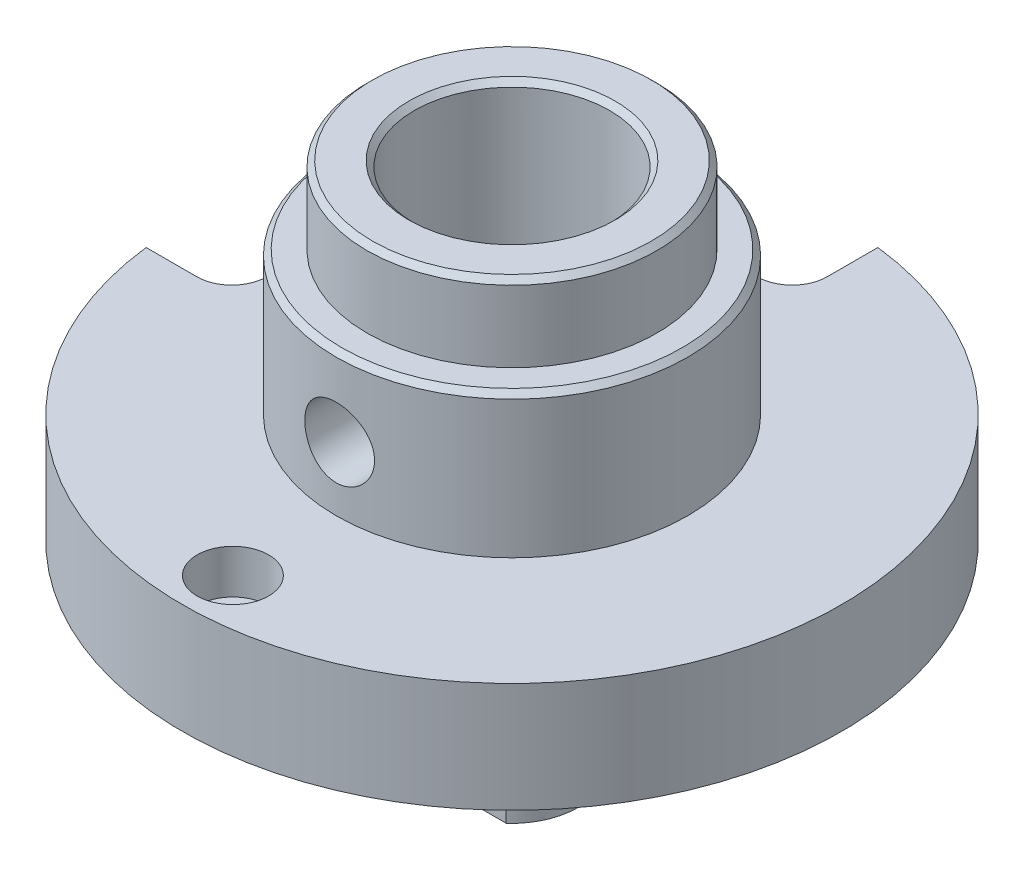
ISO-10303-21;
HEADER;
FILE_DESCRIPTION(('STEP AP214'),'2;1');
FILE_NAME('part.step','',(''),(''),'','','');
FILE_SCHEMA(('AUTOMOTIVE_DESIGN { 1 0 10303 214 1 1 1 1 }'));
ENDSEC;
DATA;
#1=APPLICATION_CONTEXT('core data for automotive mechanical design processes');
#2=APPLICATION_PROTOCOL_DEFINITION('international standard','automotive_design',2000,#1);
#3=PRODUCT_CONTEXT('',#1,'mechanical');
#4=PRODUCT('Part','Part','',(#3));
#5=PRODUCT_RELATED_PRODUCT_CATEGORY('part','',(#4));
#6=PRODUCT_DEFINITION_FORMATION('','',#4);
#7=PRODUCT_DEFINITION_CONTEXT('part definition',#1,'design');
#8=PRODUCT_DEFINITION('design','',#6,#7);
#9=PRODUCT_DEFINITION_SHAPE('','',#8);
#10=(LENGTH_UNIT() NAMED_UNIT(*) SI_UNIT(.MILLI.,.METRE.));
#11=(NAMED_UNIT(*) PLANE_ANGLE_UNIT() SI_UNIT($,.RADIAN.));
#12=(NAMED_UNIT(*) SI_UNIT($,.STERADIAN.) SOLID_ANGLE_UNIT());
#13=UNCERTAINTY_MEASURE_WITH_UNIT(LENGTH_MEASURE(1.E-05),#10,'distance_accuracy_value','');
#14=(GEOMETRIC_REPRESENTATION_CONTEXT(3) GLOBAL_UNCERTAINTY_ASSIGNED_CONTEXT((#13)) GLOBAL_UNIT_ASSIGNED_CONTEXT((#10,
#11,#12)) REPRESENTATION_CONTEXT('',''));
#15=CARTESIAN_POINT('',(0.,0.,0.));
#16=DIRECTION('',(0.,0.,1.));
#17=DIRECTION('',(1.,0.,0.));
#18=AXIS2_PLACEMENT_3D('',#15,#16,#17);
#19=CARTESIAN_POINT('',(0.,-70.5,0.));
#20=DIRECTION('',(0.,-1.,0.));
#21=DIRECTION('',(0.,0.,-1.));
#22=AXIS2_PLACEMENT_3D('',#19,#20,#21);
#23=CYLINDRICAL_SURFACE('',#22,8.);
#24=CARTESIAN_POINT('',(0.,11.25,0.));
#25=DIRECTION('',(0.,1.,0.));
#26=DIRECTION('',(0.,0.,1.));
#27=AXIS2_PLACEMENT_3D('',#24,#25,#26);
#28=CIRCLE('',#27,8.);
#29=CARTESIAN_POINT('',(0.,11.25,8.));
#30=VERTEX_POINT('',#29);
#31=EDGE_CURVE('E318',#30,#30,#28,.F.);
#32=ORIENTED_EDGE('',*,*,#31,.T.);
#33=EDGE_LOOP('',(#32));
#34=FACE_BOUND('',#33,.T.);
#35=CARTESIAN_POINT('',(0.,5.,0.));
#36=DIRECTION('',(0.,-1.,0.));
#37=DIRECTION('',(0.,0.,-1.));
#38=AXIS2_PLACEMENT_3D('',#35,#36,#37);
#39=CIRCLE('',#38,8.);
#40=CARTESIAN_POINT('',(0.,5.,-8.));
#41=VERTEX_POINT('',#40);
#42=EDGE_CURVE('E168',#41,#41,#39,.T.);
#43=ORIENTED_EDGE('',*,*,#42,.F.);
#44=EDGE_LOOP('',(#43));
#45=FACE_BOUND('',#44,.T.);
#46=CARTESIAN_POINT('',(0.,9.47750000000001,-8.));
#47=CARTESIAN_POINT('',(0.0882427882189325,9.47749673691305,-7.99999837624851));
#48=CARTESIAN_POINT('',(0.176526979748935,9.47011754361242,-7.99852498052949));
#49=CARTESIAN_POINT('',(0.350600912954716,9.44081861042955,-7.99278941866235));
#50=CARTESIAN_POINT('',(0.436388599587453,9.41888722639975,-7.98852501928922));
#51=CARTESIAN_POINT('',(0.602927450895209,9.36118729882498,-7.97768374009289));
#52=CARTESIAN_POINT('',(0.683683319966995,9.32543191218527,-7.97110905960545));
#53=CARTESIAN_POINT('',(0.838044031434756,9.24113781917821,-7.9563623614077));
#54=CARTESIAN_POINT('',(0.911649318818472,9.19259990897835,-7.94819044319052));
#55=CARTESIAN_POINT('',(1.05060737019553,9.08343189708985,-7.93102709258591));
#56=CARTESIAN_POINT('',(1.1158509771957,9.02266419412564,-7.92202703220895));
#57=CARTESIAN_POINT('',(1.23528857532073,8.89105739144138,-7.90428469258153));
#58=CARTESIAN_POINT('',(1.28948171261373,8.82021751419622,-7.89554243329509));
#59=CARTESIAN_POINT('',(1.38574328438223,8.66969383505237,-7.87922132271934));
#60=CARTESIAN_POINT('',(1.42769894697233,8.58993660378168,-7.87165357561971));
#61=CARTESIAN_POINT('',(1.49757221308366,8.42432983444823,-7.85866074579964));
#62=CARTESIAN_POINT('',(1.52549118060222,8.33848088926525,-7.85323545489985));
#63=CARTESIAN_POINT('',(1.56614469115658,8.16430122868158,-7.84522904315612));
#64=CARTESIAN_POINT('',(1.57907060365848,8.07601685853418,-7.84261210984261));
#65=CARTESIAN_POINT('',(1.58996544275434,7.89849673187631,-7.84041089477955));
#66=CARTESIAN_POINT('',(1.58793587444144,7.80926107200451,-7.84082630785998));
#67=CARTESIAN_POINT('',(1.56913214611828,7.63376978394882,-7.84461030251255));
#68=CARTESIAN_POINT('',(1.55257713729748,7.54748958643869,-7.84793498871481));
#69=CARTESIAN_POINT('',(1.50553828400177,7.37895603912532,-7.85709382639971));
#70=CARTESIAN_POINT('',(1.47505378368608,7.29670287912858,-7.86292809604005));
#71=CARTESIAN_POINT('',(1.40081138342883,7.13792546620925,-7.87649373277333));
#72=CARTESIAN_POINT('',(1.35696641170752,7.06144302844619,-7.88423747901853));
#73=CARTESIAN_POINT('',(1.25730912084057,6.9168387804,-7.90074156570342));
#74=CARTESIAN_POINT('',(1.20149544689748,6.84871791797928,-7.90950202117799));
#75=CARTESIAN_POINT('',(1.07831068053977,6.72150575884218,-7.9272427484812));
#76=CARTESIAN_POINT('',(1.01075249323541,6.66259564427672,-7.93622416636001));
#77=CARTESIAN_POINT('',(0.866618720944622,6.55691566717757,-7.95325277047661));
#78=CARTESIAN_POINT('',(0.790043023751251,6.51014595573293,-7.96129994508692));
#79=CARTESIAN_POINT('',(0.629848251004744,6.4300417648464,-7.97557267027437));
#80=CARTESIAN_POINT('',(0.546218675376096,6.39672775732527,-7.98179544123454));
#81=CARTESIAN_POINT('',(0.374398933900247,6.34467252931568,-7.99169707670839));
#82=CARTESIAN_POINT('',(0.286209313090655,6.32592957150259,-7.9953762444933));
#83=CARTESIAN_POINT('',(0.109330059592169,6.30380444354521,-7.99973396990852));
#84=CARTESIAN_POINT('',(0.0206726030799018,6.30017428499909,-8.00046096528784));
#85=CARTESIAN_POINT('',(-0.155982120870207,6.30771027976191,-7.9989668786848));
#86=CARTESIAN_POINT('',(-0.243979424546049,6.31887561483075,-7.99674595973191));
#87=CARTESIAN_POINT('',(-0.416017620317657,6.35547960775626,-7.98963588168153));
#88=CARTESIAN_POINT('',(-0.500086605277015,6.38079124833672,-7.98477047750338));
#89=CARTESIAN_POINT('',(-0.662787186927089,6.44483072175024,-7.97291496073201));
#90=CARTESIAN_POINT('',(-0.741418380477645,6.48355954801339,-7.96592469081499));
#91=CARTESIAN_POINT('',(-0.892058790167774,6.5738720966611,-7.95047418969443));
#92=CARTESIAN_POINT('',(-0.9639765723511,6.62560540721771,-7.94199722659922));
#93=CARTESIAN_POINT('',(-1.09819915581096,6.74025783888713,-7.92455347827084));
#94=CARTESIAN_POINT('',(-1.16050294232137,6.80317813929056,-7.91558664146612));
#95=CARTESIAN_POINT('',(-1.27468416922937,6.93954661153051,-7.89801082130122));
#96=CARTESIAN_POINT('',(-1.32639149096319,7.01313833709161,-7.88940920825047));
#97=CARTESIAN_POINT('',(-1.41671133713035,7.1681084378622,-7.87369286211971));
#98=CARTESIAN_POINT('',(-1.45532438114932,7.24948650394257,-7.86657807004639));
#99=CARTESIAN_POINT('',(-1.51812618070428,7.41731226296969,-7.8547002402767));
#100=CARTESIAN_POINT('',(-1.54238909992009,7.50373130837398,-7.84992513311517));
#101=CARTESIAN_POINT('',(-1.57602735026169,7.67952432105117,-7.84324149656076));
#102=CARTESIAN_POINT('',(-1.58540458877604,7.7688979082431,-7.84133259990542));
#103=CARTESIAN_POINT('',(-1.58893556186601,7.94635551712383,-7.8406176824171));
#104=CARTESIAN_POINT('',(-1.58335805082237,8.03443408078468,-7.84175688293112));
#105=CARTESIAN_POINT('',(-1.55773038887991,8.20837086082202,-7.84688752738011));
#106=CARTESIAN_POINT('',(-1.53768035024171,8.29422909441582,-7.85087894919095));
#107=CARTESIAN_POINT('',(-1.48379584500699,8.46112040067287,-7.86123999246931));
#108=CARTESIAN_POINT('',(-1.4499938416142,8.54216432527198,-7.86760401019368));
#109=CARTESIAN_POINT('',(-1.36959557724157,8.69747279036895,-7.88199647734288));
#110=CARTESIAN_POINT('',(-1.32299826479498,8.77173677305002,-7.89002506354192));
#111=CARTESIAN_POINT('',(-1.21741207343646,8.91271654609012,-7.9070099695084));
#112=CARTESIAN_POINT('',(-1.15822891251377,8.97928525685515,-7.91597956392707));
#113=CARTESIAN_POINT('',(-1.02955264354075,9.10163561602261,-7.93374005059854));
#114=CARTESIAN_POINT('',(-0.960057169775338,9.1574147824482,-7.94253090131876));
#115=CARTESIAN_POINT('',(-0.811871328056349,9.25714310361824,-7.95904983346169));
#116=CARTESIAN_POINT('',(-0.733093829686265,9.30096483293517,-7.96676606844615));
#117=CARTESIAN_POINT('',(-0.569162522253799,9.37467903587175,-7.98014988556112));
#118=CARTESIAN_POINT('',(-0.484014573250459,9.40458413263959,-7.9858193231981));
#119=CARTESIAN_POINT('',(-0.332223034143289,9.44378837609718,-7.99336234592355));
#120=CARTESIAN_POINT('',(-0.266446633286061,9.45640781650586,-7.99583696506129));
#121=CARTESIAN_POINT('',(-0.133788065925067,9.47326473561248,-7.99915638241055));
#122=CARTESIAN_POINT('',(-0.0669059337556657,9.47750247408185,-8.00000123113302));
#123=CARTESIAN_POINT('',(0.,9.47750000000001,-8.));
#124=B_SPLINE_CURVE_WITH_KNOTS('',3,(#46,#47,#48,#49,#50,#51,#52,#53,#54,#55,#56,#57,#58,#59,
#60,#61,#62,#63,#64,#65,#66,#67,#68,#69,#70,#71,#72,#73,#74,#75,#76,#77,#78,#79,#80,#81,#82,#83,
#84,#85,#86,#87,#88,#89,#90,#91,#92,#93,#94,#95,#96,#97,#98,#99,#100,#101,#102,#103,#104,#105,
#106,#107,#108,#109,#110,#111,#112,#113,#114,#115,#116,#117,#118,#119,#120,#121,#122,#123),
.UNSPECIFIED.,.T.,.F.,(4,2,2,2,2,2,2,2,2,2,2,2,2,2,2,2,2,2,2,2,2,2,2,2,2,2,2,2,2,2,2,2,2,2,2,2,
2,2,4),(0.,0.264483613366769,0.529179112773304,0.7936233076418,1.05805103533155,
1.32563942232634,1.59324847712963,1.86325089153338,2.13322706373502,2.39971799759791,
2.66618211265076,2.92869379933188,3.19121784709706,3.4554907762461,3.71979363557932,
3.98877505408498,4.25775981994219,4.52715229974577,4.79651265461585,5.06143517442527,
5.32634304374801,5.58890970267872,5.85149580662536,6.11725290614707,6.38303803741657,
6.65280357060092,6.92255839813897,7.19090662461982,7.45922046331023,7.7227448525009,
7.98626719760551,8.24917104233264,8.51209649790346,8.77942102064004,9.04680696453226,
9.3169399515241,9.58682743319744,9.78736587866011,9.98789810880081),.UNSPECIFIED.);
#125=CARTESIAN_POINT('',(0.,9.47750000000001,-8.));
#126=VERTEX_POINT('',#125);
#127=EDGE_CURVE('E193',#126,#126,#124,.T.);
#128=ORIENTED_EDGE('',*,*,#127,.F.);
#129=EDGE_LOOP('',(#128));
#130=FACE_BOUND('',#129,.T.);
#131=CARTESIAN_POINT('',(-1.5875,7.89,7.84090834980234));
#132=CARTESIAN_POINT('',(-1.58749672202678,7.9782235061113,7.84091009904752));
#133=CARTESIAN_POINT('',(-1.58012064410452,8.06648845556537,7.84241353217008));
#134=CARTESIAN_POINT('',(-1.55083520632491,8.24052243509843,7.84825616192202));
#135=CARTESIAN_POINT('',(-1.52891412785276,8.32628939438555,7.85259764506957));
#136=CARTESIAN_POINT('',(-1.47124432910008,8.4927843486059,7.86360575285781));
#137=CARTESIAN_POINT('',(-1.43550924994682,8.57351722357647,7.87027008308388));
#138=CARTESIAN_POINT('',(-1.3512630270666,8.72783916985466,7.8851702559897));
#139=CARTESIAN_POINT('',(-1.30275263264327,8.80142865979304,7.89340600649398));
#140=CARTESIAN_POINT('',(-1.19361283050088,8.94040356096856,7.91064916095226));
#141=CARTESIAN_POINT('',(-1.13283964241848,9.00567504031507,7.91966491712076));
#142=CARTESIAN_POINT('',(-1.00121003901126,9.12516671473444,7.93737869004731));
#143=CARTESIAN_POINT('',(-0.9303529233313,9.17938614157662,7.94607668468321));
#144=CARTESIAN_POINT('',(-0.779813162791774,9.27567600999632,7.96226490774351));
#145=CARTESIAN_POINT('',(-0.700060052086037,9.31763829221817,7.96974414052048));
#146=CARTESIAN_POINT('',(-0.534462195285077,9.38752492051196,7.98255835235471));
#147=CARTESIAN_POINT('',(-0.44861801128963,9.41545056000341,7.98789352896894));
#148=CARTESIAN_POINT('',(-0.274456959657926,9.45611683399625,7.99575949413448));
#149=CARTESIAN_POINT('',(-0.186186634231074,9.46904981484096,7.9983257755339));
#150=CARTESIAN_POINT('',(-0.00869430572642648,9.47996366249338,8.00048734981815));
#151=CARTESIAN_POINT('',(0.0805276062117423,9.47794594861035,8.0000829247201));
#152=CARTESIAN_POINT('',(0.256069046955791,9.45916177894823,7.99637618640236));
#153=CARTESIAN_POINT('',(0.342411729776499,9.44260250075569,7.99311458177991));
#154=CARTESIAN_POINT('',(0.51106800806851,9.39553375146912,7.98410583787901));
#155=CARTESIAN_POINT('',(0.593381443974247,9.36502372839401,7.97835860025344));
#156=CARTESIAN_POINT('',(0.752234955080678,9.29072692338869,7.96495714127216));
#157=CARTESIAN_POINT('',(0.828735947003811,9.24685876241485,7.95729128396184));
#158=CARTESIAN_POINT('',(0.973367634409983,9.14715112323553,7.94089800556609));
#159=CARTESIAN_POINT('',(1.04149737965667,9.09131028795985,7.93217046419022));
#160=CARTESIAN_POINT('',(1.16868185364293,8.96810520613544,7.91444145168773));
#161=CARTESIAN_POINT('',(1.22756078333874,8.9005596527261,7.9054378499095));
#162=CARTESIAN_POINT('',(1.33318371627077,8.75646261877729,7.88831368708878));
#163=CARTESIAN_POINT('',(1.37992749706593,8.67991097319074,7.88019314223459));
#164=CARTESIAN_POINT('',(1.46001252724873,8.51972478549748,7.86575048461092));
#165=CARTESIAN_POINT('',(1.49332569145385,8.43607583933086,7.85943214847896));
#166=CARTESIAN_POINT('',(1.54537339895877,8.26421370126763,7.84936500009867));
#167=CARTESIAN_POINT('',(1.56410981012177,8.17600109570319,7.84561585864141));
#168=CARTESIAN_POINT('',(1.586210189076,7.99910797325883,7.84117743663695));
#169=CARTESIAN_POINT('',(1.58982785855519,7.91046038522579,7.84043766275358));
#170=CARTESIAN_POINT('',(1.58227041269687,7.73382831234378,7.84196625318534));
#171=CARTESIAN_POINT('',(1.57109612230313,7.64584379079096,7.84423444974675));
#172=CARTESIAN_POINT('',(1.53449055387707,7.47388576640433,7.85147615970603));
#173=CARTESIAN_POINT('',(1.50919450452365,7.38988229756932,7.85642399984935));
#174=CARTESIAN_POINT('',(1.44520793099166,7.22730591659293,7.86844503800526));
#175=CARTESIAN_POINT('',(1.40651631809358,7.14873344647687,7.87551840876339));
#176=CARTESIAN_POINT('',(1.31626140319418,6.99813834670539,7.89110715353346));
#177=CARTESIAN_POINT('',(1.26453915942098,6.92621280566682,7.89963988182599));
#178=CARTESIAN_POINT('',(1.1499033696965,6.79196948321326,7.91713814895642));
#179=CARTESIAN_POINT('',(1.08698869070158,6.72965267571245,7.92610373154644));
#180=CARTESIAN_POINT('',(0.950615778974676,6.61543567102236,7.94362118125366));
#181=CARTESIAN_POINT('',(0.877012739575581,6.5637068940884,7.95216476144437));
#182=CARTESIAN_POINT('',(0.722013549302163,6.47334944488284,7.96773206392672));
#183=CARTESIAN_POINT('',(0.6406177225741,6.4347202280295,7.97475584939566));
#184=CARTESIAN_POINT('',(0.472797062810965,6.37190916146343,7.98645675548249));
#185=CARTESIAN_POINT('',(0.386403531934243,6.34764623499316,7.99114702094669));
#186=CARTESIAN_POINT('',(0.210664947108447,6.31399935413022,7.99770876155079));
#187=CARTESIAN_POINT('',(0.121320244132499,6.30461363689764,7.99958057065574));
#188=CARTESIAN_POINT('',(-0.0561463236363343,6.30105498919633,8.00028676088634));
#189=CARTESIAN_POINT('',(-0.144262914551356,6.30662418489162,7.99917263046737));
#190=CARTESIAN_POINT('',(-0.318277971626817,6.33224848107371,7.99414021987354));
#191=CARTESIAN_POINT('',(-0.404176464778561,6.35230340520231,7.99022197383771));
#192=CARTESIAN_POINT('',(-0.571159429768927,6.40621600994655,7.98002285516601));
#193=CARTESIAN_POINT('',(-0.652254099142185,6.44004315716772,7.97374721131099));
#194=CARTESIAN_POINT('',(-0.807653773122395,6.52050760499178,7.95950948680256));
#195=CARTESIAN_POINT('',(-0.881958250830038,6.56714589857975,7.95154727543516));
#196=CARTESIAN_POINT('',(-1.02294464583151,6.67278089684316,7.93465259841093));
#197=CARTESIAN_POINT('',(-1.08948656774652,6.73196232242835,7.92570671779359));
#198=CARTESIAN_POINT('',(-1.21178368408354,6.86062362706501,7.90793326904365));
#199=CARTESIAN_POINT('',(-1.26753632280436,6.93010593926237,7.89910572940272));
#200=CARTESIAN_POINT('',(-1.36723145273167,7.07827765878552,7.88246577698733));
#201=CARTESIAN_POINT('',(-1.41104284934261,7.15705664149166,7.87466508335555));
#202=CARTESIAN_POINT('',(-1.48473734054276,7.32099016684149,7.86110490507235));
#203=CARTESIAN_POINT('',(-1.51463313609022,7.40613881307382,7.85534356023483));
#204=CARTESIAN_POINT('',(-1.55381483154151,7.55790648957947,7.84767103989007));
#205=CARTESIAN_POINT('',(-1.56642429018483,7.62365687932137,7.84515066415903));
#206=CARTESIAN_POINT('',(-1.58326797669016,7.75626359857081,7.84176868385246));
#207=CARTESIAN_POINT('',(-1.58750248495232,7.82311989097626,7.84090702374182));
#208=CARTESIAN_POINT('',(-1.5875,7.89,7.84090834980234));
#209=B_SPLINE_CURVE_WITH_KNOTS('',3,(#131,#132,#133,#134,#135,#136,#137,#138,#139,#140,#141,
#142,#143,#144,#145,#146,#147,#148,#149,#150,#151,#152,#153,#154,#155,#156,#157,#158,#159,#160,
#161,#162,#163,#164,#165,#166,#167,#168,#169,#170,#171,#172,#173,#174,#175,#176,#177,#178,#179,
#180,#181,#182,#183,#184,#185,#186,#187,#188,#189,#190,#191,#192,#193,#194,#195,#196,#197,#198,
#199,#200,#201,#202,#203,#204,#205,#206,#207,#208),.UNSPECIFIED.,.T.,.F.,(4,2,2,2,2,2,2,2,2,2,2,
2,2,2,2,2,2,2,2,2,2,2,2,2,2,2,2,2,2,2,2,2,2,2,2,2,2,2,4),(0.,0.264425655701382,
0.529064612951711,0.793442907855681,1.05780569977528,1.32546993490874,1.59315276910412,
1.86313088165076,2.13308411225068,2.39953428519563,2.66595916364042,2.9286487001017,
3.19134863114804,3.45568210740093,3.72004556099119,3.98894572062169,4.25785080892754,
4.52731533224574,4.79674532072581,5.06163549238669,5.32651089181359,5.58889233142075,
5.85129510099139,6.11706818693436,6.38286819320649,6.65268006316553,6.92248071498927,
7.19074385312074,7.45897520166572,7.72261115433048,7.98624389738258,8.24929531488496,
8.51236712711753,8.77962209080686,9.04694028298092,9.31708469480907,9.58698205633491,
9.78744347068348,9.98789817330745),.UNSPECIFIED.);
#210=CARTESIAN_POINT('',(-1.5875,7.89,7.84090834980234));
#211=VERTEX_POINT('',#210);
#212=EDGE_CURVE('E194',#211,#211,#209,.T.);
#213=ORIENTED_EDGE('',*,*,#212,.T.);
#214=EDGE_LOOP('',(#213));
#215=FACE_BOUND('',#214,.T.);
#216=ADVANCED_FACE('F40',(#34,#45,#130,#215),#23,.T.);
#217=CARTESIAN_POINT('',(0.,-70.5,0.));
#218=DIRECTION('',(0.,-1.,0.));
#219=DIRECTION('',(0.,0.,-1.));
#220=AXIS2_PLACEMENT_3D('',#217,#218,#219);
#221=CYLINDRICAL_SURFACE('',#220,4.445);
#222=CARTESIAN_POINT('',(0.,14.75,0.));
#223=DIRECTION('',(0.,1.,0.));
#224=DIRECTION('',(0.,0.,1.));
#225=AXIS2_PLACEMENT_3D('',#222,#223,#224);
#226=CIRCLE('',#225,4.445);
#227=CARTESIAN_POINT('',(0.,14.75,4.445));
#228=VERTEX_POINT('',#227);
#229=EDGE_CURVE('E322',#228,#228,#226,.T.);
#230=ORIENTED_EDGE('',*,*,#229,.T.);
#231=EDGE_LOOP('',(#230));
#232=FACE_BOUND('',#231,.T.);
#233=CARTESIAN_POINT('',(0.,3.,0.));
#234=DIRECTION('',(0.,-1.,0.));
#235=DIRECTION('',(0.,0.,-1.));
#236=AXIS2_PLACEMENT_3D('',#233,#234,#235);
#237=CIRCLE('',#236,4.445);
#238=CARTESIAN_POINT('',(0.,3.,-4.445));
#239=VERTEX_POINT('',#238);
#240=EDGE_CURVE('E222',#239,#239,#237,.T.);
#241=ORIENTED_EDGE('',*,*,#240,.T.);
#242=EDGE_LOOP('',(#241));
#243=FACE_BOUND('',#242,.T.);
#244=CARTESIAN_POINT('',(0.,9.47750000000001,-4.445));
#245=CARTESIAN_POINT('',(-0.0862582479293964,9.47750179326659,-4.44500128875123));
#246=CARTESIAN_POINT('',(-0.172503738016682,9.47044720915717,-4.44246670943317));
#247=CARTESIAN_POINT('',(-0.34243320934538,9.44251703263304,-4.43260737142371));
#248=CARTESIAN_POINT('',(-0.426117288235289,9.42164196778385,-4.4252827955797));
#249=CARTESIAN_POINT('',(-0.588449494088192,9.36689243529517,-4.40663399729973));
#250=CARTESIAN_POINT('',(-0.667106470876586,9.33304158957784,-4.3953170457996));
#251=CARTESIAN_POINT('',(-0.817623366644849,9.25341566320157,-4.36982284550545));
#252=CARTESIAN_POINT('',(-0.889481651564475,9.20763772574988,-4.35564491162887));
#253=CARTESIAN_POINT('',(-1.02716839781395,9.10358461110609,-4.32528584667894));
#254=CARTESIAN_POINT('',(-1.09269539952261,9.0449261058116,-4.30905175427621));
#255=CARTESIAN_POINT('',(-1.21321956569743,8.91759105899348,-4.27668386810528));
#256=CARTESIAN_POINT('',(-1.26821392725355,8.8489118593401,-4.26055010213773));
#257=CARTESIAN_POINT('',(-1.3679407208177,8.70064240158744,-4.22960844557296));
#258=CARTESIAN_POINT('',(-1.41226241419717,8.62076133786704,-4.21486398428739));
#259=CARTESIAN_POINT('',(-1.48671008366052,8.45406817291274,-4.18918613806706));
#260=CARTESIAN_POINT('',(-1.51684113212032,8.36725856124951,-4.17825139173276));
#261=CARTESIAN_POINT('',(-1.56088797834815,8.19262649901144,-4.16199344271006));
#262=CARTESIAN_POINT('',(-1.57537479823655,8.10496699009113,-4.15647335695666));
#263=CARTESIAN_POINT('',(-1.5895075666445,7.92830089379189,-4.15109064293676));
#264=CARTESIAN_POINT('',(-1.58915893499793,7.83929481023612,-4.15122594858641));
#265=CARTESIAN_POINT('',(-1.5740702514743,7.66752415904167,-4.15696773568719));
#266=CARTESIAN_POINT('',(-1.56010077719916,7.58468034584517,-4.1622812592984));
#267=CARTESIAN_POINT('',(-1.51943340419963,7.42260093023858,-4.17729722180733));
#268=CARTESIAN_POINT('',(-1.4927337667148,7.34336582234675,-4.18700026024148));
#269=CARTESIAN_POINT('',(-1.42690574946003,7.18910367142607,-4.20989233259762));
#270=CARTESIAN_POINT('',(-1.38756514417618,7.11417630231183,-4.22314019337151));
#271=CARTESIAN_POINT('',(-1.29771948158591,6.97175419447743,-4.25160738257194));
#272=CARTESIAN_POINT('',(-1.24721083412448,6.9042618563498,-4.26682734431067));
#273=CARTESIAN_POINT('',(-1.13285999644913,6.77433065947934,-4.29864836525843));
#274=CARTESIAN_POINT('',(-1.06839595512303,6.71244465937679,-4.31527726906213));
#275=CARTESIAN_POINT('',(-0.929806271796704,6.60020598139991,-4.34724475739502));
#276=CARTESIAN_POINT('',(-0.855679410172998,6.54985476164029,-4.36258317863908));
#277=CARTESIAN_POINT('',(-0.698563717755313,6.46157981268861,-4.39049794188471));
#278=CARTESIAN_POINT('',(-0.615473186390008,6.42382421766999,-4.40303622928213));
#279=CARTESIAN_POINT('',(-0.443562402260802,6.36300545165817,-4.4236587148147));
#280=CARTESIAN_POINT('',(-0.354744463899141,6.33993638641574,-4.43174469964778));
#281=CARTESIAN_POINT('',(-0.178565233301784,6.31017133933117,-4.44224538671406));
#282=CARTESIAN_POINT('',(-0.0913451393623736,6.30272978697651,-4.44491811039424));
#283=CARTESIAN_POINT('',(0.0831274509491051,6.30228084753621,-4.44507809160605));
#284=CARTESIAN_POINT('',(0.170379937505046,6.30927060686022,-4.4425663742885));
#285=CARTESIAN_POINT('',(0.339324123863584,6.33690819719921,-4.43281022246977));
#286=CARTESIAN_POINT('',(0.42110396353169,6.35708126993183,-4.42573040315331));
#287=CARTESIAN_POINT('',(0.580072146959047,6.4099017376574,-4.40771436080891));
#288=CARTESIAN_POINT('',(0.657259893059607,6.44255075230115,-4.39677763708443));
#289=CARTESIAN_POINT('',(0.807286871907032,6.52040587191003,-4.37175744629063));
#290=CARTESIAN_POINT('',(0.879942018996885,6.5659402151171,-4.35759391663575));
#291=CARTESIAN_POINT('',(1.0168123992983,6.66789645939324,-4.32770531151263));
#292=CARTESIAN_POINT('',(1.08102472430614,6.7243220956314,-4.31197970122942));
#293=CARTESIAN_POINT('',(1.20270455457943,6.84995231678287,-4.27968436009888));
#294=CARTESIAN_POINT('',(1.25964113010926,6.91967219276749,-4.26311364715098));
#295=CARTESIAN_POINT('',(1.36109408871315,7.06801870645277,-4.23181701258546));
#296=CARTESIAN_POINT('',(1.40560986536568,7.14664577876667,-4.21709118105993));
#297=CARTESIAN_POINT('',(1.48087515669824,7.3109211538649,-4.19125611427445));
#298=CARTESIAN_POINT('',(1.51160994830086,7.39657685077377,-4.1801507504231));
#299=CARTESIAN_POINT('',(1.55804501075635,7.57234766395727,-4.16306915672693));
#300=CARTESIAN_POINT('',(1.573753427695,7.66246033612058,-4.15709014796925));
#301=CARTESIAN_POINT('',(1.58900022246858,7.83889550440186,-4.15128453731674));
#302=CARTESIAN_POINT('',(1.58943311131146,7.92513024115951,-4.15111759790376));
#303=CARTESIAN_POINT('',(1.57636867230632,8.09637352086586,-4.15609607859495));
#304=CARTESIAN_POINT('',(1.56287242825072,8.18138215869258,-4.16124108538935));
#305=CARTESIAN_POINT('',(1.52300309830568,8.34561287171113,-4.17599304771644));
#306=CARTESIAN_POINT('',(1.49696145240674,8.42492660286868,-4.18548486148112));
#307=CARTESIAN_POINT('',(1.43302129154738,8.57811310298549,-4.207804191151));
#308=CARTESIAN_POINT('',(1.39511992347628,8.65198455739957,-4.22063250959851));
#309=CARTESIAN_POINT('',(1.30638748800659,8.79609785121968,-4.24895791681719));
#310=CARTESIAN_POINT('',(1.25501635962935,8.86598740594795,-4.26455459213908));
#311=CARTESIAN_POINT('',(1.14167198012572,8.99644146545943,-4.29628561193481));
#312=CARTESIAN_POINT('',(1.07969552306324,9.05700313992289,-4.31242011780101));
#313=CARTESIAN_POINT('',(0.94339570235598,9.16998340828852,-4.34432357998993));
#314=CARTESIAN_POINT('',(0.868627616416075,9.22188268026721,-4.36003933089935));
#315=CARTESIAN_POINT('',(0.710889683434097,9.31234136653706,-4.38851626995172));
#316=CARTESIAN_POINT('',(0.627920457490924,9.35090179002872,-4.40127768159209));
#317=CARTESIAN_POINT('',(0.455705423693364,9.41345409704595,-4.42243213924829));
#318=CARTESIAN_POINT('',(0.366434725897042,9.4373841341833,-4.43080661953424));
#319=CARTESIAN_POINT('',(0.184770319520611,9.46940303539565,-4.4420887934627));
#320=CARTESIAN_POINT('',(0.0923778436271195,9.47749807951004,-4.44499861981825));
#321=CARTESIAN_POINT('',(0.,9.47750000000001,-4.445));
#322=B_SPLINE_CURVE_WITH_KNOTS('',3,(#244,#245,#246,#247,#248,#249,#250,#251,#252,#253,#254,
#255,#256,#257,#258,#259,#260,#261,#262,#263,#264,#265,#266,#267,#268,#269,#270,#271,#272,#273,
#274,#275,#276,#277,#278,#279,#280,#281,#282,#283,#284,#285,#286,#287,#288,#289,#290,#291,#292,
#293,#294,#295,#296,#297,#298,#299,#300,#301,#302,#303,#304,#305,#306,#307,#308,#309,#310,#311,
#312,#313,#314,#315,#316,#317,#318,#319,#320,#321),.UNSPECIFIED.,.T.,.F.,(4,2,2,2,2,2,2,2,2,2,2,
2,2,2,2,2,2,2,2,2,2,2,2,2,2,2,2,2,2,2,2,2,2,2,2,2,2,2,4),(0.,0.258434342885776,
0.516858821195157,0.774815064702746,1.03283315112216,1.29993753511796,1.56711290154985,
1.84333900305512,2.11946629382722,2.3851334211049,2.65070349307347,2.90207221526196,
3.15347528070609,3.40934135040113,3.66528979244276,3.93672474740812,4.20819399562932,
4.48315413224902,4.75800384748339,5.01941166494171,5.28076779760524,5.53319522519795,
5.78565543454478,6.04523719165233,6.30490813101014,6.5782087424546,6.85152269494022,
7.12512795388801,7.39858480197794,7.65600011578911,7.91339540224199,8.16433522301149,
8.41533545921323,8.67856687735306,8.94187801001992,9.21761831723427,9.49333775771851,
9.77021481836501,10.046983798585),.UNSPECIFIED.);
#323=CARTESIAN_POINT('',(0.,9.47750000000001,-4.445));
#324=VERTEX_POINT('',#323);
#325=EDGE_CURVE('E184',#324,#324,#322,.T.);
#326=ORIENTED_EDGE('',*,*,#325,.F.);
#327=EDGE_LOOP('',(#326));
#328=FACE_BOUND('',#327,.T.);
#329=CARTESIAN_POINT('',(-1.5875,7.89,4.15185124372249));
#330=CARTESIAN_POINT('',(-1.58750186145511,7.80394031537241,4.15184961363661));
#331=CARTESIAN_POINT('',(-1.58047848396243,7.71789349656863,4.15455616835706));
#332=CARTESIAN_POINT('',(-1.55268356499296,7.5483744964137,4.16502288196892));
#333=CARTESIAN_POINT('',(-1.53191134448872,7.46490244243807,4.17278329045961));
#334=CARTESIAN_POINT('',(-1.47746203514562,7.30302202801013,4.19236894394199));
#335=CARTESIAN_POINT('',(-1.44381332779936,7.2246029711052,4.20418524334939));
#336=CARTESIAN_POINT('',(-1.36466530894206,7.07449434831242,4.23053749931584));
#337=CARTESIAN_POINT('',(-1.3191628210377,7.0028065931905,4.24507418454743));
#338=CARTESIAN_POINT('',(-1.21540554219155,6.86496953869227,4.27596256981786));
#339=CARTESIAN_POINT('',(-1.15670535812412,6.7991666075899,4.29236418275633));
#340=CARTESIAN_POINT('',(-1.02916641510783,6.67809815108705,4.32471563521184));
#341=CARTESIAN_POINT('',(-0.960325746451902,6.62283461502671,4.34066538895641));
#342=CARTESIAN_POINT('',(-0.81187345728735,6.52278842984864,4.37090247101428));
#343=CARTESIAN_POINT('',(-0.731997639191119,6.47837627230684,4.38512436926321));
#344=CARTESIAN_POINT('',(-0.565311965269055,6.40376023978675,4.40970864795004));
#345=CARTESIAN_POINT('',(-0.478504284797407,6.37355192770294,4.42007223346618));
#346=CARTESIAN_POINT('',(-0.304056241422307,6.32939799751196,4.43541824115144));
#347=CARTESIAN_POINT('',(-0.21658407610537,6.31485737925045,4.44059696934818));
#348=CARTESIAN_POINT('',(-0.0402981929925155,6.30055157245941,4.44569086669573));
#349=CARTESIAN_POINT('',(0.048515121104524,6.30078202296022,4.44560758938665));
#350=CARTESIAN_POINT('',(0.220721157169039,6.31565161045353,4.44031535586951));
#351=CARTESIAN_POINT('',(0.304178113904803,6.32964276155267,4.43533691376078));
#352=CARTESIAN_POINT('',(0.467470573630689,6.3705547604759,4.42111035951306));
#353=CARTESIAN_POINT('',(0.547305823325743,6.39747651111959,4.41186194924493));
#354=CARTESIAN_POINT('',(0.702412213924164,6.4638197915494,4.38985982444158));
#355=CARTESIAN_POINT('',(0.777603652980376,6.50341131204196,4.37705877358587));
#356=CARTESIAN_POINT('',(0.920454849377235,6.59382475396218,4.34926332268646));
#357=CARTESIAN_POINT('',(0.988112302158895,6.64465009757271,4.33426825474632));
#358=CARTESIAN_POINT('',(1.11781112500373,6.7592750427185,4.3026987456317));
#359=CARTESIAN_POINT('',(1.17935805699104,6.82362348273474,4.28608272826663));
#360=CARTESIAN_POINT('',(1.29096205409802,6.96184811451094,4.25380126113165));
#361=CARTESIAN_POINT('',(1.34101676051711,7.03572625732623,4.23813600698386));
#362=CARTESIAN_POINT('',(1.42904147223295,7.19269230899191,4.20928243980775));
#363=CARTESIAN_POINT('',(1.46677102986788,7.27592519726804,4.19614525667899));
#364=CARTESIAN_POINT('',(1.52749952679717,7.44815395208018,4.17442484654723));
#365=CARTESIAN_POINT('',(1.55050575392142,7.53714694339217,4.16583936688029));
#366=CARTESIAN_POINT('',(1.58006234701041,7.71352326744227,4.1547161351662));
#367=CARTESIAN_POINT('',(1.58739017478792,7.80075825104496,4.15189299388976));
#368=CARTESIAN_POINT('',(1.5876073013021,7.97523819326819,4.15181045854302));
#369=CARTESIAN_POINT('',(1.58049974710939,8.06248314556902,4.15454985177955));
#370=CARTESIAN_POINT('',(1.55275025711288,8.23072434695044,4.16499614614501));
#371=CARTESIAN_POINT('',(1.53268163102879,8.31182970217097,4.17249240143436));
#372=CARTESIAN_POINT('',(1.48028611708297,8.46949459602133,4.19136588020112));
#373=CARTESIAN_POINT('',(1.44795686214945,8.54605325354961,4.20274385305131));
#374=CARTESIAN_POINT('',(1.37067546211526,8.69543411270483,4.22859135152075));
#375=CARTESIAN_POINT('',(1.32532021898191,8.76803096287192,4.24315534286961));
#376=CARTESIAN_POINT('',(1.2237152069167,8.90486190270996,4.27356458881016));
#377=CARTESIAN_POINT('',(1.16746178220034,8.96909317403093,4.28941027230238));
#378=CARTESIAN_POINT('',(1.04188922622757,9.0911296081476,4.32168024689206));
#379=CARTESIAN_POINT('',(0.972011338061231,9.14836640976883,4.33808662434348));
#380=CARTESIAN_POINT('',(0.823237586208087,9.2503558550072,4.36876018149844));
#381=CARTESIAN_POINT('',(0.744341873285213,9.29510870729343,4.3830273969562));
#382=CARTESIAN_POINT('',(0.579996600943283,9.37050264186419,4.40777619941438));
#383=CARTESIAN_POINT('',(0.494582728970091,9.40121492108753,4.41827682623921));
#384=CARTESIAN_POINT('',(0.319345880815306,9.4476847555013,4.43438493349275));
#385=CARTESIAN_POINT('',(0.229524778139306,9.46344860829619,4.43999447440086));
#386=CARTESIAN_POINT('',(0.0531860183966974,9.47894333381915,4.44551042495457));
#387=CARTESIAN_POINT('',(-0.0332520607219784,9.47948507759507,4.44570526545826));
#388=CARTESIAN_POINT('',(-0.204931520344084,9.46656823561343,4.44110341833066));
#389=CARTESIAN_POINT('',(-0.290173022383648,9.45311108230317,4.43630724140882));
#390=CARTESIAN_POINT('',(-0.455283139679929,9.41313631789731,4.42238327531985));
#391=CARTESIAN_POINT('',(-0.535225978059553,9.38689139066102,4.4133460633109));
#392=CARTESIAN_POINT('',(-0.689591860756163,9.32234848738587,4.39187518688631));
#393=CARTESIAN_POINT('',(-0.764013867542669,9.28404825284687,4.37944088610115));
#394=CARTESIAN_POINT('',(-0.908483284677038,9.19472729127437,4.35181686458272));
#395=CARTESIAN_POINT('',(-0.978236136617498,9.14325855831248,4.33653673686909));
#396=CARTESIAN_POINT('',(-1.1083724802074,9.0297916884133,4.30511614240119));
#397=CARTESIAN_POINT('',(-1.16875275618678,8.96778995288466,4.28897538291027));
#398=CARTESIAN_POINT('',(-1.28131710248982,8.83156604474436,4.25674081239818));
#399=CARTESIAN_POINT('',(-1.33298679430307,8.75690842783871,4.24068438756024));
#400=CARTESIAN_POINT('',(-1.4230400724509,8.59946110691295,4.21132223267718));
#401=CARTESIAN_POINT('',(-1.46142455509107,8.51667195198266,4.19801631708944));
#402=CARTESIAN_POINT('',(-1.52370366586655,8.34482451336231,4.17581850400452));
#403=CARTESIAN_POINT('',(-1.54753768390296,8.25574170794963,4.16694509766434));
#404=CARTESIAN_POINT('',(-1.57943089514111,8.07443327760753,4.15496378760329));
#405=CARTESIAN_POINT('',(-1.58749800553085,7.98220925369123,4.15185299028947));
#406=CARTESIAN_POINT('',(-1.5875,7.89,4.15185124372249));
#407=B_SPLINE_CURVE_WITH_KNOTS('',3,(#329,#330,#331,#332,#333,#334,#335,#336,#337,#338,#339,
#340,#341,#342,#343,#344,#345,#346,#347,#348,#349,#350,#351,#352,#353,#354,#355,#356,#357,#358,
#359,#360,#361,#362,#363,#364,#365,#366,#367,#368,#369,#370,#371,#372,#373,#374,#375,#376,#377,
#378,#379,#380,#381,#382,#383,#384,#385,#386,#387,#388,#389,#390,#391,#392,#393,#394,#395,#396,
#397,#398,#399,#400,#401,#402,#403,#404,#405,#406),.UNSPECIFIED.,.T.,.F.,(4,2,2,2,2,2,2,2,2,2,2,
2,2,2,2,2,2,2,2,2,2,2,2,2,2,2,2,2,2,2,2,2,2,2,2,2,2,2,4),(0.,0.257836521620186,0.51568577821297,
0.772969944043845,1.03032312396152,1.29820036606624,1.56612812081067,1.84221636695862,
2.11821830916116,2.38332302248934,2.64834946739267,2.90146573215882,3.15459967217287,
3.41128331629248,3.66804526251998,3.93855046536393,4.20911113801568,4.4846723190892,
4.76009699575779,5.02151303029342,5.28287207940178,5.53339598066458,5.78396827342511,
6.04333237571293,6.30278363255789,6.57689850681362,6.85100879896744,7.12371328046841,
7.39630282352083,7.65434251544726,7.91235580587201,8.16509329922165,8.41787816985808,
8.68078665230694,8.9437851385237,9.21906437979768,9.49432504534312,9.77072462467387,
10.0469853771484),.UNSPECIFIED.);
#408=CARTESIAN_POINT('',(-1.5875,7.89,4.15185124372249));
#409=VERTEX_POINT('',#408);
#410=EDGE_CURVE('E195',#409,#409,#407,.T.);
#411=ORIENTED_EDGE('',*,*,#410,.T.);
#412=EDGE_LOOP('',(#411));
#413=FACE_BOUND('',#412,.T.);
#414=ADVANCED_FACE('F201',(#232,#243,#328,#413),#221,.F.);
#415=CARTESIAN_POINT('',(6.6,15.,0.));
#416=DIRECTION('',(0.,1.,0.));
#417=DIRECTION('',(0.,0.,1.));
#418=AXIS2_PLACEMENT_3D('',#415,#416,#417);
#419=PLANE('',#418);
#420=CARTESIAN_POINT('',(0.,15.,0.));
#421=DIRECTION('',(0.,1.,0.));
#422=DIRECTION('',(0.,0.,1.));
#423=AXIS2_PLACEMENT_3D('',#420,#421,#422);
#424=CIRCLE('',#423,4.695);
#425=CARTESIAN_POINT('',(0.,15.,4.695));
#426=VERTEX_POINT('',#425);
#427=EDGE_CURVE('E326',#426,#426,#424,.F.);
#428=ORIENTED_EDGE('',*,*,#427,.T.);
#429=EDGE_LOOP('',(#428));
#430=FACE_BOUND('',#429,.T.);
#431=CARTESIAN_POINT('',(0.,15.,0.));
#432=DIRECTION('',(0.,1.,0.));
#433=DIRECTION('',(0.,0.,1.));
#434=AXIS2_PLACEMENT_3D('',#431,#432,#433);
#435=CIRCLE('',#434,6.34999999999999);
#436=CARTESIAN_POINT('',(0.,15.,6.34999999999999));
#437=VERTEX_POINT('',#436);
#438=EDGE_CURVE('E183',#437,#437,#435,.T.);
#439=ORIENTED_EDGE('',*,*,#438,.T.);
#440=EDGE_LOOP('',(#439));
#441=FACE_BOUND('',#440,.T.);
#442=ADVANCED_FACE('F242',(#430,#441),#419,.T.);
#443=CARTESIAN_POINT('',(0.,-70.5,0.));
#444=DIRECTION('',(0.,-1.,0.));
#445=DIRECTION('',(0.,0.,-1.));
#446=AXIS2_PLACEMENT_3D('',#443,#444,#445);
#447=CYLINDRICAL_SURFACE('',#446,6.6);
#448=CARTESIAN_POINT('',(0.,14.75,0.));
#449=DIRECTION('',(0.,1.,0.));
#450=DIRECTION('',(0.,0.,1.));
#451=AXIS2_PLACEMENT_3D('',#448,#449,#450);
#452=CIRCLE('',#451,6.6);
#453=CARTESIAN_POINT('',(0.,14.75,6.6));
#454=VERTEX_POINT('',#453);
#455=EDGE_CURVE('E310',#454,#454,#452,.F.);
#456=ORIENTED_EDGE('',*,*,#455,.T.);
#457=EDGE_LOOP('',(#456));
#458=FACE_BOUND('',#457,.T.);
#459=CARTESIAN_POINT('',(0.,11.5,0.));
#460=DIRECTION('',(0.,-1.,0.));
#461=DIRECTION('',(0.,0.,-1.));
#462=AXIS2_PLACEMENT_3D('',#459,#460,#461);
#463=CIRCLE('',#462,6.6);
#464=CARTESIAN_POINT('',(0.,11.5,-6.6));
#465=VERTEX_POINT('',#464);
#466=EDGE_CURVE('E179',#465,#465,#463,.T.);
#467=ORIENTED_EDGE('',*,*,#466,.F.);
#468=EDGE_LOOP('',(#467));
#469=FACE_BOUND('',#468,.T.);
#470=ADVANCED_FACE('F238',(#458,#469),#447,.T.);
#471=CARTESIAN_POINT('',(6.6,11.5,0.));
#472=DIRECTION('',(0.,1.,0.));
#473=DIRECTION('',(0.,0.,1.));
#474=AXIS2_PLACEMENT_3D('',#471,#472,#473);
#475=PLANE('',#474);
#476=CARTESIAN_POINT('',(0.,11.5,0.));
#477=DIRECTION('',(0.,1.,0.));
#478=DIRECTION('',(0.,0.,1.));
#479=AXIS2_PLACEMENT_3D('',#476,#477,#478);
#480=CIRCLE('',#479,7.74999999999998);
#481=CARTESIAN_POINT('',(0.,11.5,7.74999999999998));
#482=VERTEX_POINT('',#481);
#483=EDGE_CURVE('E314',#482,#482,#480,.T.);
#484=ORIENTED_EDGE('',*,*,#483,.T.);
#485=EDGE_LOOP('',(#484));
#486=FACE_BOUND('',#485,.T.);
#487=ORIENTED_EDGE('',*,*,#466,.T.);
#488=EDGE_LOOP('',(#487));
#489=FACE_BOUND('',#488,.T.);
#490=ADVANCED_FACE('F234',(#486,#489),#475,.T.);
#491=CARTESIAN_POINT('',(15.,5.,0.));
#492=DIRECTION('',(0.,1.,0.));
#493=DIRECTION('',(0.,0.,1.));
#494=AXIS2_PLACEMENT_3D('',#491,#492,#493);
#495=PLANE('',#494);
#496=DIRECTION('',(0.,0.,-1.));
#497=VECTOR('',#496,1.);
#498=CARTESIAN_POINT('',(1.75,5.,-14.8975669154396));
#499=LINE('',#498,#497);
#500=CARTESIAN_POINT('',(1.75,5.,-12.5875));
#501=VERTEX_POINT('',#500);
#502=CARTESIAN_POINT('',(1.75,5.,-14.8975669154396));
#503=VERTEX_POINT('',#502);
#504=EDGE_CURVE('E150',#501,#503,#499,.T.);
#505=ORIENTED_EDGE('',*,*,#504,.F.);
#506=CARTESIAN_POINT('',(0.162499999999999,5.,-12.5875));
#507=DIRECTION('',(0.,1.,0.));
#508=DIRECTION('',(0.,0.,1.));
#509=AXIS2_PLACEMENT_3D('',#506,#507,#508);
#510=CIRCLE('',#509,1.5875);
#511=CARTESIAN_POINT('',(0.162499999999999,5.,-11.));
#512=VERTEX_POINT('',#511);
#513=EDGE_CURVE('E49',#501,#512,#510,.F.);
#514=ORIENTED_EDGE('',*,*,#513,.T.);
#515=DIRECTION('',(1.,0.,0.));
#516=VECTOR('',#515,1.);
#517=CARTESIAN_POINT('',(0.,5.,-11.));
#518=LINE('',#517,#516);
#519=CARTESIAN_POINT('',(0.,5.,-11.));
#520=VERTEX_POINT('',#519);
#521=EDGE_CURVE('E374',#520,#512,#518,.T.);
#522=ORIENTED_EDGE('',*,*,#521,.F.);
#523=CARTESIAN_POINT('',(0.,5.,0.));
#524=DIRECTION('',(0.,-1.,0.));
#525=DIRECTION('',(0.,0.,1.));
#526=AXIS2_PLACEMENT_3D('',#523,#524,#525);
#527=CIRCLE('',#526,11.);
#528=CARTESIAN_POINT('',(-11.,5.,0.));
#529=VERTEX_POINT('',#528);
#530=EDGE_CURVE('E366',#529,#520,#527,.T.);
#531=ORIENTED_EDGE('',*,*,#530,.F.);
#532=DIRECTION('',(0.,0.,-1.));
#533=VECTOR('',#532,1.);
#534=CARTESIAN_POINT('',(-11.,5.,0.));
#535=LINE('',#534,#533);
#536=CARTESIAN_POINT('',(-11.,5.,0.1625));
#537=VERTEX_POINT('',#536);
#538=EDGE_CURVE('E364',#537,#529,#535,.T.);
#539=ORIENTED_EDGE('',*,*,#538,.F.);
#540=CARTESIAN_POINT('',(-12.5875,5.,0.1625));
#541=DIRECTION('',(0.,1.,0.));
#542=DIRECTION('',(0.,0.,1.));
#543=AXIS2_PLACEMENT_3D('',#540,#541,#542);
#544=CIRCLE('',#543,1.5875);
#545=CARTESIAN_POINT('',(-12.5875,5.,1.75));
#546=VERTEX_POINT('',#545);
#547=EDGE_CURVE('E283',#537,#546,#544,.F.);
#548=ORIENTED_EDGE('',*,*,#547,.T.);
#549=DIRECTION('',(1.,0.,0.));
#550=VECTOR('',#549,1.);
#551=CARTESIAN_POINT('',(-14.8975669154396,5.,1.75));
#552=LINE('',#551,#550);
#553=CARTESIAN_POINT('',(-14.8975669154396,5.,1.75));
#554=VERTEX_POINT('',#553);
#555=EDGE_CURVE('E144',#554,#546,#552,.T.);
#556=ORIENTED_EDGE('',*,*,#555,.F.);
#557=CARTESIAN_POINT('',(0.,5.,0.));
#558=DIRECTION('',(0.,-1.,0.));
#559=DIRECTION('',(0.,0.,-1.));
#560=AXIS2_PLACEMENT_3D('',#557,#558,#559);
#561=CIRCLE('',#560,15.);
#562=EDGE_CURVE('E162',#503,#554,#561,.T.);
#563=ORIENTED_EDGE('',*,*,#562,.F.);
#564=EDGE_LOOP('',(#505,#514,#522,#531,#539,#548,#556,#563));
#565=FACE_BOUND('',#564,.T.);
#566=CARTESIAN_POINT('',(0.,5.,12.7));
#567=DIRECTION('',(0.,1.,0.));
#568=DIRECTION('',(0.,0.,1.));
#569=AXIS2_PLACEMENT_3D('',#566,#567,#568);
#570=CIRCLE('',#569,1.6256);
#571=CARTESIAN_POINT('',(0.,5.,14.3256));
#572=VERTEX_POINT('',#571);
#573=EDGE_CURVE('E351',#572,#572,#570,.T.);
#574=ORIENTED_EDGE('',*,*,#573,.F.);
#575=EDGE_LOOP('',(#574));
#576=FACE_BOUND('',#575,.T.);
#577=ORIENTED_EDGE('',*,*,#42,.T.);
#578=EDGE_LOOP('',(#577));
#579=FACE_BOUND('',#578,.T.);
#580=ADVANCED_FACE('F232',(#565,#576,#579),#495,.T.);
#581=CARTESIAN_POINT('',(0.,-70.5,0.));
#582=DIRECTION('',(0.,-1.,0.));
#583=DIRECTION('',(0.,0.,-1.));
#584=AXIS2_PLACEMENT_3D('',#581,#582,#583);
#585=CYLINDRICAL_SURFACE('',#584,15.);
#586=DIRECTION('',(0.,1.,0.));
#587=VECTOR('',#586,1.);
#588=CARTESIAN_POINT('',(1.75,-9.001,-14.8975669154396));
#589=LINE('',#588,#587);
#590=CARTESIAN_POINT('',(1.75,0.,-14.8975669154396));
#591=VERTEX_POINT('',#590);
#592=EDGE_CURVE('E148',#591,#503,#589,.T.);
#593=ORIENTED_EDGE('',*,*,#592,.T.);
#594=ORIENTED_EDGE('',*,*,#562,.T.);
#595=DIRECTION('',(0.,1.,0.));
#596=VECTOR('',#595,1.);
#597=CARTESIAN_POINT('',(-14.8975669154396,-9.001,1.75));
#598=LINE('',#597,#596);
#599=CARTESIAN_POINT('',(-14.8975669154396,0.,1.75));
#600=VERTEX_POINT('',#599);
#601=EDGE_CURVE('E160',#600,#554,#598,.T.);
#602=ORIENTED_EDGE('',*,*,#601,.F.);
#603=CARTESIAN_POINT('',(0.,0.,0.));
#604=DIRECTION('',(0.,-1.,0.));
#605=DIRECTION('',(0.,0.,-1.));
#606=AXIS2_PLACEMENT_3D('',#603,#604,#605);
#607=CIRCLE('',#606,15.);
#608=EDGE_CURVE('E138',#591,#600,#607,.T.);
#609=ORIENTED_EDGE('',*,*,#608,.F.);
#610=EDGE_LOOP('',(#593,#594,#602,#609));
#611=FACE_BOUND('',#610,.T.);
#612=ADVANCED_FACE('F159',(#611),#585,.T.);
#613=CARTESIAN_POINT('',(3.,0.,0.));
#614=DIRECTION('',(0.,-1.,0.));
#615=DIRECTION('',(0.,0.,-1.));
#616=AXIS2_PLACEMENT_3D('',#613,#614,#615);
#617=PLANE('',#616);
#618=CARTESIAN_POINT('',(0.,0.,12.7));
#619=DIRECTION('',(0.,-1.,0.));
#620=DIRECTION('',(0.,0.,-1.));
#621=AXIS2_PLACEMENT_3D('',#618,#619,#620);
#622=CIRCLE('',#621,1.13029999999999);
#623=CARTESIAN_POINT('',(0.,0.,11.5697));
#624=VERTEX_POINT('',#623);
#625=EDGE_CURVE('E303',#624,#624,#622,.T.);
#626=ORIENTED_EDGE('',*,*,#625,.F.);
#627=EDGE_LOOP('',(#626));
#628=FACE_BOUND('',#627,.T.);
#629=CARTESIAN_POINT('',(0.,0.,0.));
#630=DIRECTION('',(0.,-1.,0.));
#631=DIRECTION('',(0.,0.,-1.));
#632=AXIS2_PLACEMENT_3D('',#629,#630,#631);
#633=CIRCLE('',#632,4.5875);
#634=CARTESIAN_POINT('',(0.,0.,-4.5875));
#635=VERTEX_POINT('',#634);
#636=EDGE_CURVE('E298',#635,#635,#633,.F.);
#637=ORIENTED_EDGE('',*,*,#636,.T.);
#638=EDGE_LOOP('',(#637));
#639=FACE_BOUND('',#638,.T.);
#640=DIRECTION('',(1.,0.,0.));
#641=VECTOR('',#640,1.);
#642=CARTESIAN_POINT('',(0.,0.,-11.));
#643=LINE('',#642,#641);
#644=CARTESIAN_POINT('',(0.,0.,-11.));
#645=VERTEX_POINT('',#644);
#646=CARTESIAN_POINT('',(0.162499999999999,0.,-11.));
#647=VERTEX_POINT('',#646);
#648=EDGE_CURVE('E145',#645,#647,#643,.T.);
#649=ORIENTED_EDGE('',*,*,#648,.T.);
#650=CARTESIAN_POINT('',(0.162499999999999,0.,-12.5875));
#651=DIRECTION('',(0.,-1.,0.));
#652=DIRECTION('',(0.,0.,-1.));
#653=AXIS2_PLACEMENT_3D('',#650,#651,#652);
#654=CIRCLE('',#653,1.5875);
#655=CARTESIAN_POINT('',(1.75,0.,-12.5875));
#656=VERTEX_POINT('',#655);
#657=EDGE_CURVE('E11',#647,#656,#654,.F.);
#658=ORIENTED_EDGE('',*,*,#657,.T.);
#659=DIRECTION('',(0.,0.,-1.));
#660=VECTOR('',#659,1.);
#661=CARTESIAN_POINT('',(1.75,0.,-14.8975669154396));
#662=LINE('',#661,#660);
#663=EDGE_CURVE('E133',#656,#591,#662,.T.);
#664=ORIENTED_EDGE('',*,*,#663,.T.);
#665=ORIENTED_EDGE('',*,*,#608,.T.);
#666=DIRECTION('',(1.,0.,0.));
#667=VECTOR('',#666,1.);
#668=CARTESIAN_POINT('',(-14.8975669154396,0.,1.75));
#669=LINE('',#668,#667);
#670=CARTESIAN_POINT('',(-12.5875,0.,1.75));
#671=VERTEX_POINT('',#670);
#672=EDGE_CURVE('E155',#600,#671,#669,.T.);
#673=ORIENTED_EDGE('',*,*,#672,.T.);
#674=CARTESIAN_POINT('',(-12.5875,0.,0.1625));
#675=DIRECTION('',(0.,-1.,0.));
#676=DIRECTION('',(0.,0.,-1.));
#677=AXIS2_PLACEMENT_3D('',#674,#675,#676);
#678=CIRCLE('',#677,1.5875);
#679=CARTESIAN_POINT('',(-11.,0.,0.1625));
#680=VERTEX_POINT('',#679);
#681=EDGE_CURVE('E277',#671,#680,#678,.F.);
#682=ORIENTED_EDGE('',*,*,#681,.T.);
#683=DIRECTION('',(0.,0.,-1.));
#684=VECTOR('',#683,1.);
#685=CARTESIAN_POINT('',(-11.,0.,0.));
#686=LINE('',#685,#684);
#687=CARTESIAN_POINT('',(-11.,0.,0.));
#688=VERTEX_POINT('',#687);
#689=EDGE_CURVE('E414',#680,#688,#686,.T.);
#690=ORIENTED_EDGE('',*,*,#689,.T.);
#691=CARTESIAN_POINT('',(0.,0.,0.));
#692=DIRECTION('',(0.,-1.,0.));
#693=DIRECTION('',(0.,0.,-1.));
#694=AXIS2_PLACEMENT_3D('',#691,#692,#693);
#695=CIRCLE('',#694,11.);
#696=EDGE_CURVE('E410',#688,#645,#695,.T.);
#697=ORIENTED_EDGE('',*,*,#696,.T.);
#698=EDGE_LOOP('',(#649,#658,#664,#665,#673,#682,#690,#697));
#699=FACE_BOUND('',#698,.T.);
#700=ADVANCED_FACE('F135',(#628,#639,#699),#617,.T.);
#701=CARTESIAN_POINT('',(0.,-70.5,0.));
#702=DIRECTION('',(0.,-1.,0.));
#703=DIRECTION('',(0.,0.,-1.));
#704=AXIS2_PLACEMENT_3D('',#701,#702,#703);
#705=CYLINDRICAL_SURFACE('',#704,3.);
#706=CARTESIAN_POINT('',(0.,-1.58750000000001,0.));
#707=DIRECTION('',(0.,-1.,0.));
#708=DIRECTION('',(0.,0.,-1.));
#709=AXIS2_PLACEMENT_3D('',#706,#707,#708);
#710=CIRCLE('',#709,3.);
#711=CARTESIAN_POINT('',(0.,-1.58750000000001,-3.));
#712=VERTEX_POINT('',#711);
#713=EDGE_CURVE('E307',#712,#712,#710,.T.);
#714=ORIENTED_EDGE('',*,*,#713,.T.);
#715=EDGE_LOOP('',(#714));
#716=FACE_BOUND('',#715,.T.);
#717=DIRECTION('',(0.,-1.,0.));
#718=VECTOR('',#717,1.);
#719=CARTESIAN_POINT('',(1.98431348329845,-2.,2.25));
#720=LINE('',#719,#718);
#721=CARTESIAN_POINT('',(1.98431348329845,-2.,2.25));
#722=VERTEX_POINT('',#721);
#723=CARTESIAN_POINT('',(1.98431348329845,-9.,2.25));
#724=VERTEX_POINT('',#723);
#725=EDGE_CURVE('E341',#722,#724,#720,.T.);
#726=ORIENTED_EDGE('',*,*,#725,.T.);
#727=CARTESIAN_POINT('',(0.,-9.,0.));
#728=DIRECTION('',(0.,-1.,0.));
#729=DIRECTION('',(0.,0.,-1.));
#730=AXIS2_PLACEMENT_3D('',#727,#728,#729);
#731=CIRCLE('',#730,3.);
#732=CARTESIAN_POINT('',(-1.98431348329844,-9.,2.25));
#733=VERTEX_POINT('',#732);
#734=EDGE_CURVE('E163',#733,#724,#731,.T.);
#735=ORIENTED_EDGE('',*,*,#734,.F.);
#736=DIRECTION('',(0.,-1.,0.));
#737=VECTOR('',#736,1.);
#738=CARTESIAN_POINT('',(-1.98431348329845,-2.,2.25));
#739=LINE('',#738,#737);
#740=CARTESIAN_POINT('',(-1.98431348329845,-2.,2.25));
#741=VERTEX_POINT('',#740);
#742=EDGE_CURVE('E339',#741,#733,#739,.T.);
#743=ORIENTED_EDGE('',*,*,#742,.F.);
#744=CARTESIAN_POINT('',(0.,-2.,0.));
#745=DIRECTION('',(0.,-1.,0.));
#746=DIRECTION('',(0.,0.,1.));
#747=AXIS2_PLACEMENT_3D('',#744,#745,#746);
#748=CIRCLE('',#747,3.);
#749=EDGE_CURVE('E344',#722,#741,#748,.T.);
#750=ORIENTED_EDGE('',*,*,#749,.F.);
#751=EDGE_LOOP('',(#726,#735,#743,#750));
#752=FACE_BOUND('',#751,.T.);
#753=ADVANCED_FACE('F426',(#716,#752),#705,.T.);
#754=CARTESIAN_POINT('',(0.,-9.,0.));
#755=DIRECTION('',(0.,-1.,0.));
#756=DIRECTION('',(0.,0.,-1.));
#757=AXIS2_PLACEMENT_3D('',#754,#755,#756);
#758=PLANE('',#757);
#759=DIRECTION('',(1.,0.,0.));
#760=VECTOR('',#759,1.);
#761=CARTESIAN_POINT('',(-1.98431348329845,-9.,2.25));
#762=LINE('',#761,#760);
#763=EDGE_CURVE('E346',#733,#724,#762,.T.);
#764=ORIENTED_EDGE('',*,*,#763,.F.);
#765=ORIENTED_EDGE('',*,*,#734,.T.);
#766=EDGE_LOOP('',(#764,#765));
#767=FACE_BOUND('',#766,.T.);
#768=ADVANCED_FACE('F434',(#767),#758,.T.);
#769=CARTESIAN_POINT('',(3.945,2.5,0.));
#770=DIRECTION('',(0.,1.,0.));
#771=DIRECTION('',(0.,0.,1.));
#772=AXIS2_PLACEMENT_3D('',#769,#770,#771);
#773=PLANE('',#772);
#774=CARTESIAN_POINT('',(0.,2.5,0.));
#775=DIRECTION('',(0.,-1.,0.));
#776=DIRECTION('',(0.,0.,-1.));
#777=AXIS2_PLACEMENT_3D('',#774,#775,#776);
#778=CIRCLE('',#777,3.945);
#779=CARTESIAN_POINT('',(0.,2.5,-3.945));
#780=VERTEX_POINT('',#779);
#781=EDGE_CURVE('E172',#780,#780,#778,.T.);
#782=ORIENTED_EDGE('',*,*,#781,.F.);
#783=EDGE_LOOP('',(#782));
#784=FACE_BOUND('',#783,.T.);
#785=ADVANCED_FACE('F486',(#784),#773,.T.);
#786=CARTESIAN_POINT('',(0.,3.,0.));
#787=DIRECTION('',(0.,-1.,0.));
#788=DIRECTION('',(0.,0.,-1.));
#789=AXIS2_PLACEMENT_3D('',#786,#787,#788);
#790=TOROIDAL_SURFACE('',#789,3.945,0.5);
#791=ORIENTED_EDGE('',*,*,#781,.T.);
#792=EDGE_LOOP('',(#791));
#793=FACE_BOUND('',#792,.T.);
#794=ORIENTED_EDGE('',*,*,#240,.F.);
#795=EDGE_LOOP('',(#794));
#796=FACE_BOUND('',#795,.T.);
#797=ADVANCED_FACE('F208',(#793,#796),#790,.F.);
#798=CARTESIAN_POINT('',(0.,7.89,-15.));
#799=DIRECTION('',(0.,0.,1.));
#800=DIRECTION('',(1.,0.,0.));
#801=AXIS2_PLACEMENT_3D('',#798,#799,#800);
#802=CYLINDRICAL_SURFACE('',#801,1.5875);
#803=ORIENTED_EDGE('',*,*,#127,.T.);
#804=EDGE_LOOP('',(#803));
#805=FACE_BOUND('',#804,.T.);
#806=ORIENTED_EDGE('',*,*,#325,.T.);
#807=EDGE_LOOP('',(#806));
#808=FACE_BOUND('',#807,.T.);
#809=ADVANCED_FACE('F204',(#805,#808),#802,.F.);
#810=CARTESIAN_POINT('',(0.,7.89,15.));
#811=DIRECTION('',(0.,0.,-1.));
#812=DIRECTION('',(-1.,0.,0.));
#813=AXIS2_PLACEMENT_3D('',#810,#811,#812);
#814=CYLINDRICAL_SURFACE('',#813,1.5875);
#815=ORIENTED_EDGE('',*,*,#212,.F.);
#816=EDGE_LOOP('',(#815));
#817=FACE_BOUND('',#816,.T.);
#818=ORIENTED_EDGE('',*,*,#410,.F.);
#819=EDGE_LOOP('',(#818));
#820=FACE_BOUND('',#819,.T.);
#821=ADVANCED_FACE('F207',(#817,#820),#814,.F.);
#822=CARTESIAN_POINT('',(0.,3.,12.7));
#823=DIRECTION('',(0.,1.,0.));
#824=DIRECTION('',(0.,0.,1.));
#825=AXIS2_PLACEMENT_3D('',#822,#823,#824);
#826=PLANE('',#825);
#827=CARTESIAN_POINT('',(0.,3.,12.7));
#828=DIRECTION('',(0.,1.,0.));
#829=DIRECTION('',(0.,0.,1.));
#830=AXIS2_PLACEMENT_3D('',#827,#828,#829);
#831=CIRCLE('',#830,1.13029999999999);
#832=CARTESIAN_POINT('',(0.,3.,13.8303));
#833=VERTEX_POINT('',#832);
#834=EDGE_CURVE('E299',#833,#833,#831,.T.);
#835=ORIENTED_EDGE('',*,*,#834,.F.);
#836=EDGE_LOOP('',(#835));
#837=FACE_BOUND('',#836,.T.);
#838=CARTESIAN_POINT('',(0.,3.,12.7));
#839=DIRECTION('',(0.,1.,0.));
#840=DIRECTION('',(0.,0.,1.));
#841=AXIS2_PLACEMENT_3D('',#838,#839,#840);
#842=CIRCLE('',#841,1.6256);
#843=CARTESIAN_POINT('',(0.,3.,14.3256));
#844=VERTEX_POINT('',#843);
#845=EDGE_CURVE('E354',#844,#844,#842,.T.);
#846=ORIENTED_EDGE('',*,*,#845,.T.);
#847=EDGE_LOOP('',(#846));
#848=FACE_BOUND('',#847,.T.);
#849=ADVANCED_FACE('F390',(#837,#848),#826,.T.);
#850=CARTESIAN_POINT('',(0.,3.,12.7));
#851=DIRECTION('',(0.,1.,0.));
#852=DIRECTION('',(0.,0.,1.));
#853=AXIS2_PLACEMENT_3D('',#850,#851,#852);
#854=CYLINDRICAL_SURFACE('',#853,1.6256);
#855=ORIENTED_EDGE('',*,*,#845,.F.);
#856=EDGE_LOOP('',(#855));
#857=FACE_BOUND('',#856,.T.);
#858=ORIENTED_EDGE('',*,*,#573,.T.);
#859=EDGE_LOOP('',(#858));
#860=FACE_BOUND('',#859,.T.);
#861=ADVANCED_FACE('F392',(#857,#860),#854,.F.);
#862=CARTESIAN_POINT('',(-1.98431348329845,-2.,2.25));
#863=DIRECTION('',(0.,0.,-1.));
#864=DIRECTION('',(-1.,0.,0.));
#865=AXIS2_PLACEMENT_3D('',#862,#863,#864);
#866=PLANE('',#865);
#867=ORIENTED_EDGE('',*,*,#763,.T.);
#868=ORIENTED_EDGE('',*,*,#725,.F.);
#869=DIRECTION('',(1.,0.,0.));
#870=VECTOR('',#869,1.);
#871=CARTESIAN_POINT('',(-1.98431348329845,-2.,2.25));
#872=LINE('',#871,#870);
#873=EDGE_CURVE('E342',#741,#722,#872,.T.);
#874=ORIENTED_EDGE('',*,*,#873,.F.);
#875=ORIENTED_EDGE('',*,*,#742,.T.);
#876=EDGE_LOOP('',(#867,#868,#874,#875));
#877=FACE_BOUND('',#876,.T.);
#878=ADVANCED_FACE('F395',(#877),#866,.F.);
#879=CARTESIAN_POINT('',(0.,-2.,0.));
#880=DIRECTION('',(0.,1.,0.));
#881=DIRECTION('',(0.,0.,1.));
#882=AXIS2_PLACEMENT_3D('',#879,#880,#881);
#883=PLANE('',#882);
#884=ORIENTED_EDGE('',*,*,#749,.T.);
#885=ORIENTED_EDGE('',*,*,#873,.T.);
#886=EDGE_LOOP('',(#884,#885));
#887=FACE_BOUND('',#886,.T.);
#888=ADVANCED_FACE('F444',(#887),#883,.F.);
#889=CARTESIAN_POINT('',(1.75,-9.001,-14.8975669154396));
#890=DIRECTION('',(1.,0.,0.));
#891=DIRECTION('',(0.,0.,-1.));
#892=AXIS2_PLACEMENT_3D('',#889,#890,#891);
#893=PLANE('',#892);
#894=ORIENTED_EDGE('',*,*,#663,.F.);
#895=DIRECTION('',(0.,1.,0.));
#896=VECTOR('',#895,1.);
#897=CARTESIAN_POINT('',(1.75,5.,-12.5875));
#898=LINE('',#897,#896);
#899=EDGE_CURVE('E292',#656,#501,#898,.T.);
#900=ORIENTED_EDGE('',*,*,#899,.T.);
#901=ORIENTED_EDGE('',*,*,#504,.T.);
#902=ORIENTED_EDGE('',*,*,#592,.F.);
#903=EDGE_LOOP('',(#894,#900,#901,#902));
#904=FACE_BOUND('',#903,.T.);
#905=ADVANCED_FACE('F149',(#904),#893,.F.);
#906=CARTESIAN_POINT('',(0.,-9.001,-11.));
#907=DIRECTION('',(0.,0.,1.));
#908=DIRECTION('',(1.,0.,0.));
#909=AXIS2_PLACEMENT_3D('',#906,#907,#908);
#910=PLANE('',#909);
#911=ORIENTED_EDGE('',*,*,#521,.T.);
#912=DIRECTION('',(0.,1.,0.));
#913=VECTOR('',#912,1.);
#914=CARTESIAN_POINT('',(0.162499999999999,0.,-11.));
#915=LINE('',#914,#913);
#916=EDGE_CURVE('E59',#512,#647,#915,.F.);
#917=ORIENTED_EDGE('',*,*,#916,.T.);
#918=ORIENTED_EDGE('',*,*,#648,.F.);
#919=DIRECTION('',(0.,1.,0.));
#920=VECTOR('',#919,1.);
#921=CARTESIAN_POINT('',(0.,-9.001,-11.));
#922=LINE('',#921,#920);
#923=EDGE_CURVE('E156',#645,#520,#922,.T.);
#924=ORIENTED_EDGE('',*,*,#923,.T.);
#925=EDGE_LOOP('',(#911,#917,#918,#924));
#926=FACE_BOUND('',#925,.T.);
#927=ADVANCED_FACE('F451',(#926),#910,.F.);
#928=CARTESIAN_POINT('',(0.,-9.001,0.));
#929=DIRECTION('',(0.,1.,0.));
#930=DIRECTION('',(0.,0.,1.));
#931=AXIS2_PLACEMENT_3D('',#928,#929,#930);
#932=CYLINDRICAL_SURFACE('',#931,11.);
#933=DIRECTION('',(0.,1.,0.));
#934=VECTOR('',#933,1.);
#935=CARTESIAN_POINT('',(-11.,-9.001,0.));
#936=LINE('',#935,#934);
#937=EDGE_CURVE('E380',#688,#529,#936,.T.);
#938=ORIENTED_EDGE('',*,*,#937,.T.);
#939=ORIENTED_EDGE('',*,*,#530,.T.);
#940=ORIENTED_EDGE('',*,*,#923,.F.);
#941=ORIENTED_EDGE('',*,*,#696,.F.);
#942=EDGE_LOOP('',(#938,#939,#940,#941));
#943=FACE_BOUND('',#942,.T.);
#944=ADVANCED_FACE('F540',(#943),#932,.T.);
#945=CARTESIAN_POINT('',(-11.,-9.001,0.));
#946=DIRECTION('',(1.,0.,0.));
#947=DIRECTION('',(0.,0.,-1.));
#948=AXIS2_PLACEMENT_3D('',#945,#946,#947);
#949=PLANE('',#948);
#950=ORIENTED_EDGE('',*,*,#689,.F.);
#951=DIRECTION('',(0.,1.,0.));
#952=VECTOR('',#951,1.);
#953=CARTESIAN_POINT('',(-11.,5.,0.1625));
#954=LINE('',#953,#952);
#955=EDGE_CURVE('E280',#680,#537,#954,.T.);
#956=ORIENTED_EDGE('',*,*,#955,.T.);
#957=ORIENTED_EDGE('',*,*,#538,.T.);
#958=ORIENTED_EDGE('',*,*,#937,.F.);
#959=EDGE_LOOP('',(#950,#956,#957,#958));
#960=FACE_BOUND('',#959,.T.);
#961=ADVANCED_FACE('F545',(#960),#949,.F.);
#962=CARTESIAN_POINT('',(-14.8975669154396,-9.001,1.75));
#963=DIRECTION('',(0.,0.,1.));
#964=DIRECTION('',(1.,0.,0.));
#965=AXIS2_PLACEMENT_3D('',#962,#963,#964);
#966=PLANE('',#965);
#967=ORIENTED_EDGE('',*,*,#555,.T.);
#968=DIRECTION('',(0.,1.,0.));
#969=VECTOR('',#968,1.);
#970=CARTESIAN_POINT('',(-12.5875,0.,1.75));
#971=LINE('',#970,#969);
#972=EDGE_CURVE('E278',#546,#671,#971,.F.);
#973=ORIENTED_EDGE('',*,*,#972,.T.);
#974=ORIENTED_EDGE('',*,*,#672,.F.);
#975=ORIENTED_EDGE('',*,*,#601,.T.);
#976=EDGE_LOOP('',(#967,#973,#974,#975));
#977=FACE_BOUND('',#976,.T.);
#978=ADVANCED_FACE('F251',(#977),#966,.F.);
#979=CARTESIAN_POINT('',(0.,15.,0.));
#980=DIRECTION('',(0.,1.,0.));
#981=DIRECTION('',(0.,0.,1.));
#982=AXIS2_PLACEMENT_3D('',#979,#980,#981);
#983=CONICAL_SURFACE('',#982,4.695,0.78539816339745);
#984=ORIENTED_EDGE('',*,*,#229,.F.);
#985=EDGE_LOOP('',(#984));
#986=FACE_BOUND('',#985,.T.);
#987=ORIENTED_EDGE('',*,*,#427,.F.);
#988=EDGE_LOOP('',(#987));
#989=FACE_BOUND('',#988,.T.);
#990=ADVANCED_FACE('F247',(#986,#989),#983,.F.);
#991=CARTESIAN_POINT('',(0.,11.25,0.));
#992=DIRECTION('',(0.,-1.,0.));
#993=DIRECTION('',(0.,0.,-1.));
#994=AXIS2_PLACEMENT_3D('',#991,#992,#993);
#995=CONICAL_SURFACE('',#994,8.,0.785398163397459);
#996=ORIENTED_EDGE('',*,*,#483,.F.);
#997=EDGE_LOOP('',(#996));
#998=FACE_BOUND('',#997,.T.);
#999=ORIENTED_EDGE('',*,*,#31,.F.);
#1000=EDGE_LOOP('',(#999));
#1001=FACE_BOUND('',#1000,.T.);
#1002=ADVANCED_FACE('F250',(#998,#1001),#995,.T.);
#1003=CARTESIAN_POINT('',(0.,14.75,0.));
#1004=DIRECTION('',(0.,-1.,0.));
#1005=DIRECTION('',(0.,0.,-1.));
#1006=AXIS2_PLACEMENT_3D('',#1003,#1004,#1005);
#1007=CONICAL_SURFACE('',#1006,6.6,0.785398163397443);
#1008=ORIENTED_EDGE('',*,*,#438,.F.);
#1009=EDGE_LOOP('',(#1008));
#1010=FACE_BOUND('',#1009,.T.);
#1011=ORIENTED_EDGE('',*,*,#455,.F.);
#1012=EDGE_LOOP('',(#1011));
#1013=FACE_BOUND('',#1012,.T.);
#1014=ADVANCED_FACE('F255',(#1010,#1013),#1007,.T.);
#1015=CARTESIAN_POINT('',(0.,-1.58750000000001,0.));
#1016=DIRECTION('',(0.,-1.,0.));
#1017=DIRECTION('',(0.,0.,-1.));
#1018=AXIS2_PLACEMENT_3D('',#1015,#1016,#1017);
#1019=TOROIDAL_SURFACE('',#1018,4.5875,1.5875);
#1020=ORIENTED_EDGE('',*,*,#636,.F.);
#1021=EDGE_LOOP('',(#1020));
#1022=FACE_BOUND('',#1021,.T.);
#1023=ORIENTED_EDGE('',*,*,#713,.F.);
#1024=EDGE_LOOP('',(#1023));
#1025=FACE_BOUND('',#1024,.T.);
#1026=ADVANCED_FACE('F259',(#1022,#1025),#1019,.F.);
#1027=CARTESIAN_POINT('',(0.,5.,12.7));
#1028=DIRECTION('',(0.,1.,0.));
#1029=DIRECTION('',(0.,0.,1.));
#1030=AXIS2_PLACEMENT_3D('',#1027,#1028,#1029);
#1031=CYLINDRICAL_SURFACE('',#1030,1.13029999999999);
#1032=ORIENTED_EDGE('',*,*,#625,.T.);
#1033=EDGE_LOOP('',(#1032));
#1034=FACE_BOUND('',#1033,.T.);
#1035=ORIENTED_EDGE('',*,*,#834,.T.);
#1036=EDGE_LOOP('',(#1035));
#1037=FACE_BOUND('',#1036,.T.);
#1038=ADVANCED_FACE('F262',(#1034,#1037),#1031,.F.);
#1039=CARTESIAN_POINT('',(-12.5875,-9.001,0.1625));
#1040=DIRECTION('',(0.,-1.,0.));
#1041=DIRECTION('',(0.,0.,-1.));
#1042=AXIS2_PLACEMENT_3D('',#1039,#1040,#1041);
#1043=CYLINDRICAL_SURFACE('',#1042,1.5875);
#1044=ORIENTED_EDGE('',*,*,#681,.F.);
#1045=ORIENTED_EDGE('',*,*,#972,.F.);
#1046=ORIENTED_EDGE('',*,*,#547,.F.);
#1047=ORIENTED_EDGE('',*,*,#955,.F.);
#1048=EDGE_LOOP('',(#1044,#1045,#1046,#1047));
#1049=FACE_BOUND('',#1048,.T.);
#1050=ADVANCED_FACE('F264',(#1049),#1043,.F.);
#1051=CARTESIAN_POINT('',(0.162499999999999,-9.001,-12.5875));
#1052=DIRECTION('',(0.,-1.,0.));
#1053=DIRECTION('',(0.,0.,-1.));
#1054=AXIS2_PLACEMENT_3D('',#1051,#1052,#1053);
#1055=CYLINDRICAL_SURFACE('',#1054,1.5875);
#1056=ORIENTED_EDGE('',*,*,#657,.F.);
#1057=ORIENTED_EDGE('',*,*,#916,.F.);
#1058=ORIENTED_EDGE('',*,*,#513,.F.);
#1059=ORIENTED_EDGE('',*,*,#899,.F.);
#1060=EDGE_LOOP('',(#1056,#1057,#1058,#1059));
#1061=FACE_BOUND('',#1060,.T.);
#1062=ADVANCED_FACE('F42',(#1061),#1055,.F.);
#1063=CLOSED_SHELL('',(#216,#414,#442,#470,#490,#580,#612,#700,#753,#768,#785,#797,#809,#821,
#849,#861,#878,#888,#905,#927,#944,#961,#978,#990,#1002,#1014,#1026,#1038,#1050,#1062));
#1064=MANIFOLD_SOLID_BREP('B2',#1063);
#1065=ADVANCED_BREP_SHAPE_REPRESENTATION('',(#18,#1064),#14);
#1066=SHAPE_DEFINITION_REPRESENTATION(#9,#1065);
ENDSEC;
END-ISO-10303-21;
